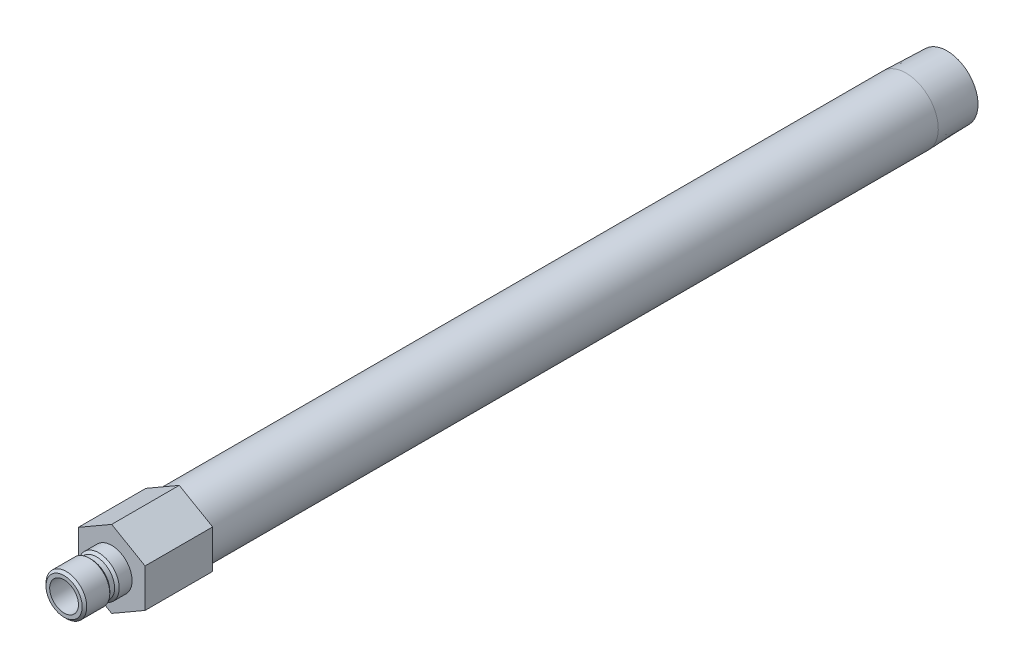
from build123d import *

# Parameters (mm, degrees)
SKETCH2_R           = 4.7625
BOSS_EXTRUDE1_DEPTH = 22.352


with BuildPart() as part:
    # Sketch1 → Revolve1 (revolve)
    with BuildSketch(Plane(origin=(0, 0, 0), x_dir=(0, 0, -1), z_dir=(1, 0, 0))):
        Polygon((-15.748, 4.7625), (-15.748, 5.9817), (-14.986, 6.7437), (-7.366, 6.7437), (-6.604, 5.9817), (-5.0165, 5.9817), (-4.2545, 6.7437), (0, 6.7437), (0, 10.668), (262.7884, 10.668), (276.352, 10.244140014), (276.352, 7.8994), (22.352, 7.8994), (22.352, 4.7625), align=None)
    revolve(axis=Axis((0, 0, 0), (0, 0, 1)))

    # Sketch2 → Boss-Extrude1 (add)
    with BuildSketch(Plane.XY):
        Polygon((-11.049, 6.379143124), (-11.049, -6.379143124), (0, -12.758286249), (11.049, -6.379143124), (11.049, 6.379143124), (0, 12.758286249), align=None)
        with Locations(Location((0, 0, 0), (0, 0, 90))):
            Circle(SKETCH2_R, mode=Mode.SUBTRACT)
    extrude(amount=-BOSS_EXTRUDE1_DEPTH)


solid = part.part
